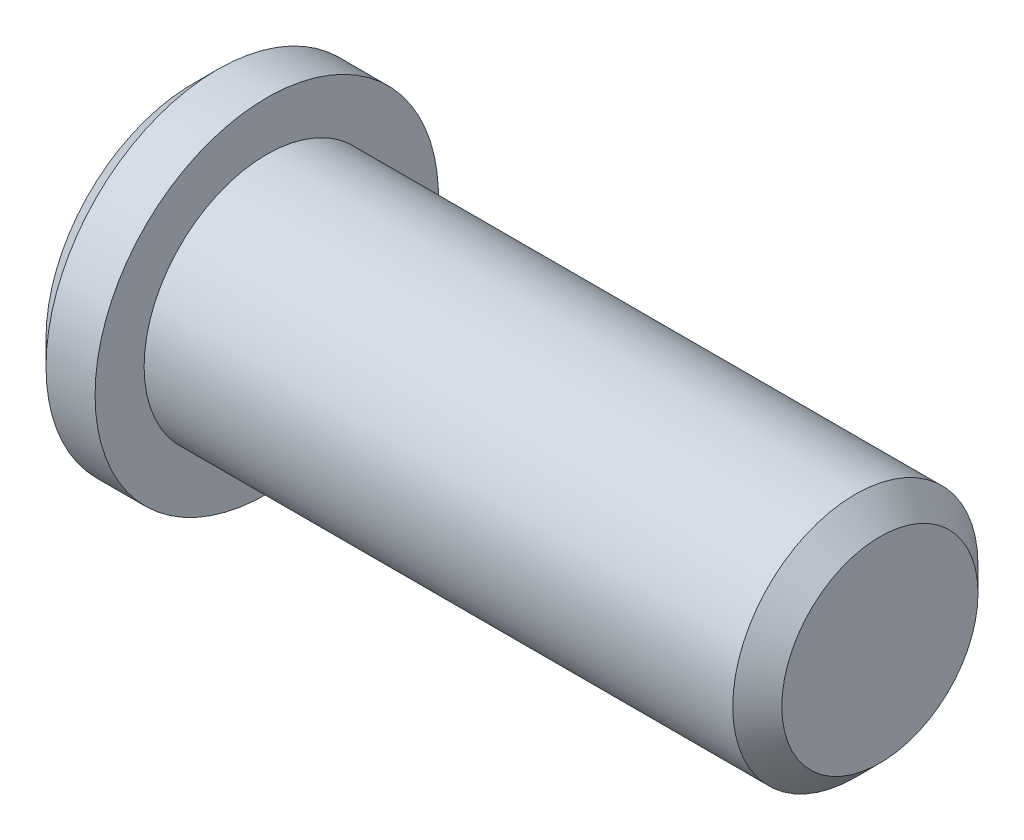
ISO-10303-21;
HEADER;
FILE_DESCRIPTION(('STEP AP214'),'2;1');
FILE_NAME('part.step','',(''),(''),'','','');
FILE_SCHEMA(('AUTOMOTIVE_DESIGN { 1 0 10303 214 1 1 1 1 }'));
ENDSEC;
DATA;
#1=APPLICATION_CONTEXT('core data for automotive mechanical design processes');
#2=APPLICATION_PROTOCOL_DEFINITION('international standard','automotive_design',2000,#1);
#3=PRODUCT_CONTEXT('',#1,'mechanical');
#4=PRODUCT('Part','Part','',(#3));
#5=PRODUCT_RELATED_PRODUCT_CATEGORY('part','',(#4));
#6=PRODUCT_DEFINITION_FORMATION('','',#4);
#7=PRODUCT_DEFINITION_CONTEXT('part definition',#1,'design');
#8=PRODUCT_DEFINITION('design','',#6,#7);
#9=PRODUCT_DEFINITION_SHAPE('','',#8);
#10=(LENGTH_UNIT() NAMED_UNIT(*) SI_UNIT(.MILLI.,.METRE.));
#11=(NAMED_UNIT(*) PLANE_ANGLE_UNIT() SI_UNIT($,.RADIAN.));
#12=(NAMED_UNIT(*) SI_UNIT($,.STERADIAN.) SOLID_ANGLE_UNIT());
#13=UNCERTAINTY_MEASURE_WITH_UNIT(LENGTH_MEASURE(1.E-05),#10,'distance_accuracy_value','');
#14=(GEOMETRIC_REPRESENTATION_CONTEXT(3) GLOBAL_UNCERTAINTY_ASSIGNED_CONTEXT((#13)) GLOBAL_UNIT_ASSIGNED_CONTEXT((#10,
#11,#12)) REPRESENTATION_CONTEXT('',''));
#15=CARTESIAN_POINT('',(0.,0.,0.));
#16=DIRECTION('',(0.,0.,1.));
#17=DIRECTION('',(1.,0.,0.));
#18=AXIS2_PLACEMENT_3D('',#15,#16,#17);
#19=CARTESIAN_POINT('',(-37.1544117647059,5.,0.));
#20=DIRECTION('',(-1.,0.,0.));
#21=DIRECTION('',(0.,0.,1.));
#22=AXIS2_PLACEMENT_3D('',#19,#20,#21);
#23=PLANE('',#22);
#24=CARTESIAN_POINT('',(-37.1544117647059,0.,0.));
#25=DIRECTION('',(-1.,0.,0.));
#26=DIRECTION('',(0.,0.,1.));
#27=AXIS2_PLACEMENT_3D('',#24,#25,#26);
#28=CIRCLE('',#27,7.);
#29=CARTESIAN_POINT('',(-37.1544117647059,0.,7.));
#30=VERTEX_POINT('',#29);
#31=EDGE_CURVE('E49',#30,#30,#28,.T.);
#32=ORIENTED_EDGE('',*,*,#31,.F.);
#33=EDGE_LOOP('',(#32));
#34=FACE_BOUND('',#33,.T.);
#35=CARTESIAN_POINT('',(-37.1544117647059,0.,0.));
#36=DIRECTION('',(-1.,0.,0.));
#37=DIRECTION('',(0.,0.,1.));
#38=AXIS2_PLACEMENT_3D('',#35,#36,#37);
#39=CIRCLE('',#38,5.);
#40=CARTESIAN_POINT('',(-37.1544117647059,0.,5.));
#41=VERTEX_POINT('',#40);
#42=EDGE_CURVE('E52',#41,#41,#39,.T.);
#43=ORIENTED_EDGE('',*,*,#42,.T.);
#44=EDGE_LOOP('',(#43));
#45=FACE_BOUND('',#44,.T.);
#46=ADVANCED_FACE('F29',(#34,#45),#23,.F.);
#47=CARTESIAN_POINT('',(-84.2308823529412,0.,0.));
#48=DIRECTION('',(-1.,0.,0.));
#49=DIRECTION('',(0.,0.,1.));
#50=AXIS2_PLACEMENT_3D('',#47,#48,#49);
#51=CYLINDRICAL_SURFACE('',#50,7.);
#52=CARTESIAN_POINT('',(-39.1544117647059,0.,0.));
#53=DIRECTION('',(1.,0.,0.));
#54=DIRECTION('',(0.,0.,-1.));
#55=AXIS2_PLACEMENT_3D('',#52,#53,#54);
#56=CIRCLE('',#55,7.);
#57=CARTESIAN_POINT('',(-39.1544117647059,0.,-7.));
#58=VERTEX_POINT('',#57);
#59=EDGE_CURVE('E10',#58,#58,#56,.T.);
#60=ORIENTED_EDGE('',*,*,#59,.T.);
#61=EDGE_LOOP('',(#60));
#62=FACE_BOUND('',#61,.T.);
#63=ORIENTED_EDGE('',*,*,#31,.T.);
#64=EDGE_LOOP('',(#63));
#65=FACE_BOUND('',#64,.T.);
#66=ADVANCED_FACE('F72',(#62,#65),#51,.T.);
#67=CARTESIAN_POINT('',(-40.1544117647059,7.,0.));
#68=DIRECTION('',(1.,0.,0.));
#69=DIRECTION('',(0.,0.,-1.));
#70=AXIS2_PLACEMENT_3D('',#67,#68,#69);
#71=PLANE('',#70);
#72=CARTESIAN_POINT('',(-40.1544117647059,0.,0.));
#73=DIRECTION('',(1.,0.,0.));
#74=DIRECTION('',(0.,0.,-1.));
#75=AXIS2_PLACEMENT_3D('',#72,#73,#74);
#76=CIRCLE('',#75,5.99999999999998);
#77=CARTESIAN_POINT('',(-40.1544117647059,0.,-5.99999999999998));
#78=VERTEX_POINT('',#77);
#79=EDGE_CURVE('E36',#78,#78,#76,.F.);
#80=ORIENTED_EDGE('',*,*,#79,.T.);
#81=EDGE_LOOP('',(#80));
#82=FACE_BOUND('',#81,.T.);
#83=ADVANCED_FACE('F68',(#82),#71,.F.);
#84=CARTESIAN_POINT('',(-12.1544117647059,5.,0.));
#85=DIRECTION('',(-1.,0.,0.));
#86=DIRECTION('',(0.,0.,1.));
#87=AXIS2_PLACEMENT_3D('',#84,#85,#86);
#88=PLANE('',#87);
#89=CARTESIAN_POINT('',(-12.1544117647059,0.,0.));
#90=DIRECTION('',(-1.,0.,0.));
#91=DIRECTION('',(0.,0.,1.));
#92=AXIS2_PLACEMENT_3D('',#89,#90,#91);
#93=CIRCLE('',#92,4.);
#94=CARTESIAN_POINT('',(-12.1544117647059,0.,4.));
#95=VERTEX_POINT('',#94);
#96=EDGE_CURVE('E40',#95,#95,#93,.F.);
#97=ORIENTED_EDGE('',*,*,#96,.T.);
#98=EDGE_LOOP('',(#97));
#99=FACE_BOUND('',#98,.T.);
#100=ADVANCED_FACE('F60',(#99),#88,.F.);
#101=CARTESIAN_POINT('',(-84.2308823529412,0.,0.));
#102=DIRECTION('',(-1.,0.,0.));
#103=DIRECTION('',(0.,0.,1.));
#104=AXIS2_PLACEMENT_3D('',#101,#102,#103);
#105=CYLINDRICAL_SURFACE('',#104,5.);
#106=CARTESIAN_POINT('',(-13.1544117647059,0.,0.));
#107=DIRECTION('',(-1.,0.,0.));
#108=DIRECTION('',(0.,0.,1.));
#109=AXIS2_PLACEMENT_3D('',#106,#107,#108);
#110=CIRCLE('',#109,5.);
#111=CARTESIAN_POINT('',(-13.1544117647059,0.,5.));
#112=VERTEX_POINT('',#111);
#113=EDGE_CURVE('E44',#112,#112,#110,.T.);
#114=ORIENTED_EDGE('',*,*,#113,.T.);
#115=EDGE_LOOP('',(#114));
#116=FACE_BOUND('',#115,.T.);
#117=ORIENTED_EDGE('',*,*,#42,.F.);
#118=EDGE_LOOP('',(#117));
#119=FACE_BOUND('',#118,.T.);
#120=ADVANCED_FACE('F57',(#116,#119),#105,.T.);
#121=CARTESIAN_POINT('',(-13.1544117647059,0.,0.));
#122=DIRECTION('',(-1.,0.,0.));
#123=DIRECTION('',(0.,0.,1.));
#124=AXIS2_PLACEMENT_3D('',#121,#122,#123);
#125=CONICAL_SURFACE('',#124,5.,0.785398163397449);
#126=ORIENTED_EDGE('',*,*,#96,.F.);
#127=EDGE_LOOP('',(#126));
#128=FACE_BOUND('',#127,.T.);
#129=ORIENTED_EDGE('',*,*,#113,.F.);
#130=EDGE_LOOP('',(#129));
#131=FACE_BOUND('',#130,.T.);
#132=ADVANCED_FACE('F59',(#128,#131),#125,.T.);
#133=CARTESIAN_POINT('',(-40.1544117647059,0.,0.));
#134=DIRECTION('',(1.,0.,0.));
#135=DIRECTION('',(0.,0.,-1.));
#136=AXIS2_PLACEMENT_3D('',#133,#134,#135);
#137=CONICAL_SURFACE('',#136,5.99999999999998,0.785398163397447);
#138=ORIENTED_EDGE('',*,*,#59,.F.);
#139=EDGE_LOOP('',(#138));
#140=FACE_BOUND('',#139,.T.);
#141=ORIENTED_EDGE('',*,*,#79,.F.);
#142=EDGE_LOOP('',(#141));
#143=FACE_BOUND('',#142,.T.);
#144=ADVANCED_FACE('F31',(#140,#143),#137,.T.);
#145=CLOSED_SHELL('',(#46,#66,#83,#100,#120,#132,#144));
#146=MANIFOLD_SOLID_BREP('B2',#145);
#147=ADVANCED_BREP_SHAPE_REPRESENTATION('',(#18,#146),#14);
#148=SHAPE_DEFINITION_REPRESENTATION(#9,#147);
ENDSEC;
END-ISO-10303-21;
